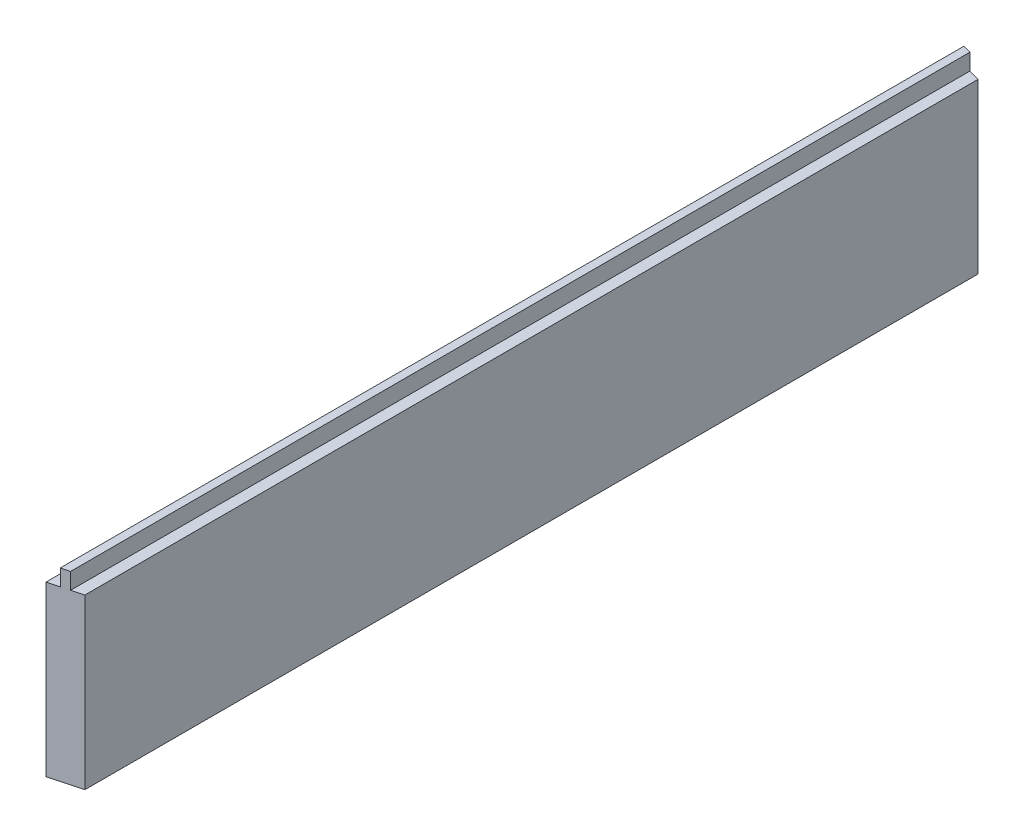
ISO-10303-21;
HEADER;
FILE_DESCRIPTION(('STEP AP214'),'2;1');
FILE_NAME('part.step','',(''),(''),'','','');
FILE_SCHEMA(('AUTOMOTIVE_DESIGN { 1 0 10303 214 1 1 1 1 }'));
ENDSEC;
DATA;
#1=APPLICATION_CONTEXT('core data for automotive mechanical design processes');
#2=APPLICATION_PROTOCOL_DEFINITION('international standard','automotive_design',2000,#1);
#3=PRODUCT_CONTEXT('',#1,'mechanical');
#4=PRODUCT('Part','Part','',(#3));
#5=PRODUCT_RELATED_PRODUCT_CATEGORY('part','',(#4));
#6=PRODUCT_DEFINITION_FORMATION('','',#4);
#7=PRODUCT_DEFINITION_CONTEXT('part definition',#1,'design');
#8=PRODUCT_DEFINITION('design','',#6,#7);
#9=PRODUCT_DEFINITION_SHAPE('','',#8);
#10=(LENGTH_UNIT() NAMED_UNIT(*) SI_UNIT(.MILLI.,.METRE.));
#11=(NAMED_UNIT(*) PLANE_ANGLE_UNIT() SI_UNIT($,.RADIAN.));
#12=(NAMED_UNIT(*) SI_UNIT($,.STERADIAN.) SOLID_ANGLE_UNIT());
#13=UNCERTAINTY_MEASURE_WITH_UNIT(LENGTH_MEASURE(1.E-05),#10,'distance_accuracy_value','');
#14=(GEOMETRIC_REPRESENTATION_CONTEXT(3) GLOBAL_UNCERTAINTY_ASSIGNED_CONTEXT((#13)) GLOBAL_UNIT_ASSIGNED_CONTEXT((#10,
#11,#12)) REPRESENTATION_CONTEXT('',''));
#15=CARTESIAN_POINT('',(0.,0.,0.));
#16=DIRECTION('',(0.,0.,1.));
#17=DIRECTION('',(1.,0.,0.));
#18=AXIS2_PLACEMENT_3D('',#15,#16,#17);
#19=CARTESIAN_POINT('',(0.,41.2499999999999,445.));
#20=DIRECTION('',(0.,-1.,0.));
#21=DIRECTION('',(1.,0.,0.));
#22=AXIS2_PLACEMENT_3D('',#19,#20,#21);
#23=PLANE('',#22);
#24=DIRECTION('',(0.965925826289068,0.,0.258819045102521));
#25=VECTOR('',#24,1.);
#26=CARTESIAN_POINT('',(110.747595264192,41.2499999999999,31.6843476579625));
#27=LINE('',#26,#25);
#28=CARTESIAN_POINT('',(2.,41.2499999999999,2.54551732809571));
#29=VERTEX_POINT('',#28);
#30=CARTESIAN_POINT('',(7.49999999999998,41.2499999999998,4.01923788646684));
#31=VERTEX_POINT('',#30);
#32=EDGE_CURVE('E102',#29,#31,#27,.T.);
#33=ORIENTED_EDGE('',*,*,#32,.F.);
#34=DIRECTION('',(0.,0.,-1.));
#35=VECTOR('',#34,1.);
#36=CARTESIAN_POINT('',(2.,41.2499999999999,445.));
#37=LINE('',#36,#35);
#38=CARTESIAN_POINT('',(2.,41.2499999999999,442.454482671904));
#39=VERTEX_POINT('',#38);
#40=EDGE_CURVE('E11',#39,#29,#37,.T.);
#41=ORIENTED_EDGE('',*,*,#40,.F.);
#42=DIRECTION('',(0.965925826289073,0.,-0.258819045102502));
#43=VECTOR('',#42,1.);
#44=CARTESIAN_POINT('',(-0.502404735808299,41.2499999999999,443.125));
#45=LINE('',#44,#43);
#46=CARTESIAN_POINT('',(7.49999999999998,41.2499999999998,440.980762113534));
#47=VERTEX_POINT('',#46);
#48=EDGE_CURVE('E166',#39,#47,#45,.T.);
#49=ORIENTED_EDGE('',*,*,#48,.T.);
#50=DIRECTION('',(0.,0.,-1.));
#51=VECTOR('',#50,1.);
#52=CARTESIAN_POINT('',(7.49999999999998,41.2499999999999,445.));
#53=LINE('',#52,#51);
#54=EDGE_CURVE('E121',#47,#31,#53,.T.);
#55=ORIENTED_EDGE('',*,*,#54,.T.);
#56=EDGE_LOOP('',(#33,#41,#49,#55));
#57=FACE_BOUND('',#56,.T.);
#58=ADVANCED_FACE('F36',(#57),#23,.F.);
#59=CARTESIAN_POINT('',(2.,0.,445.));
#60=DIRECTION('',(1.,0.,0.));
#61=DIRECTION('',(0.,1.,0.));
#62=AXIS2_PLACEMENT_3D('',#59,#60,#61);
#63=PLANE('',#62);
#64=ORIENTED_EDGE('',*,*,#40,.T.);
#65=DIRECTION('',(0.,1.,0.));
#66=VECTOR('',#65,1.);
#67=CARTESIAN_POINT('',(2.,0.,2.54551732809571));
#68=LINE('',#67,#66);
#69=CARTESIAN_POINT('',(1.99999999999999,49.2499999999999,2.54551732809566));
#70=VERTEX_POINT('',#69);
#71=EDGE_CURVE('E149',#29,#70,#68,.T.);
#72=ORIENTED_EDGE('',*,*,#71,.T.);
#73=DIRECTION('',(0.,0.,-1.));
#74=VECTOR('',#73,1.);
#75=CARTESIAN_POINT('',(2.,49.2499999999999,445.));
#76=LINE('',#75,#74);
#77=CARTESIAN_POINT('',(1.99999999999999,49.2499999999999,442.454482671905));
#78=VERTEX_POINT('',#77);
#79=EDGE_CURVE('E45',#78,#70,#76,.T.);
#80=ORIENTED_EDGE('',*,*,#79,.F.);
#81=DIRECTION('',(0.,1.,0.));
#82=VECTOR('',#81,1.);
#83=CARTESIAN_POINT('',(2.,0.,442.454482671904));
#84=LINE('',#83,#82);
#85=EDGE_CURVE('E147',#39,#78,#84,.T.);
#86=ORIENTED_EDGE('',*,*,#85,.F.);
#87=EDGE_LOOP('',(#64,#72,#80,#86));
#88=FACE_BOUND('',#87,.T.);
#89=ADVANCED_FACE('F38',(#88),#63,.T.);
#90=CARTESIAN_POINT('',(0.,49.2499999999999,445.));
#91=DIRECTION('',(0.,1.,0.));
#92=DIRECTION('',(0.,0.,1.));
#93=AXIS2_PLACEMENT_3D('',#90,#91,#92);
#94=PLANE('',#93);
#95=ORIENTED_EDGE('',*,*,#79,.T.);
#96=DIRECTION('',(-0.965925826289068,0.,-0.258819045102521));
#97=VECTOR('',#96,1.);
#98=CARTESIAN_POINT('',(7.49999999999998,49.2499999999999,4.01923788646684));
#99=LINE('',#98,#97);
#100=CARTESIAN_POINT('',(-2.,49.2499999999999,1.47372055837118));
#101=VERTEX_POINT('',#100);
#102=EDGE_CURVE('E116',#70,#101,#99,.T.);
#103=ORIENTED_EDGE('',*,*,#102,.T.);
#104=DIRECTION('',(0.,0.,-1.));
#105=VECTOR('',#104,1.);
#106=CARTESIAN_POINT('',(-2.,49.2499999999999,445.));
#107=LINE('',#106,#105);
#108=CARTESIAN_POINT('',(-2.,49.2499999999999,443.526279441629));
#109=VERTEX_POINT('',#108);
#110=EDGE_CURVE('E134',#109,#101,#107,.T.);
#111=ORIENTED_EDGE('',*,*,#110,.F.);
#112=DIRECTION('',(-0.965925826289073,0.,0.258819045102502));
#113=VECTOR('',#112,1.);
#114=CARTESIAN_POINT('',(7.49999999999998,49.2499999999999,440.980762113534));
#115=LINE('',#114,#113);
#116=EDGE_CURVE('E143',#78,#109,#115,.T.);
#117=ORIENTED_EDGE('',*,*,#116,.F.);
#118=EDGE_LOOP('',(#95,#103,#111,#117));
#119=FACE_BOUND('',#118,.T.);
#120=ADVANCED_FACE('F141',(#119),#94,.T.);
#121=CARTESIAN_POINT('',(-2.,0.,445.));
#122=DIRECTION('',(1.,0.,0.));
#123=DIRECTION('',(0.,1.,0.));
#124=AXIS2_PLACEMENT_3D('',#121,#122,#123);
#125=PLANE('',#124);
#126=DIRECTION('',(0.,1.,0.));
#127=VECTOR('',#126,1.);
#128=CARTESIAN_POINT('',(-2.,0.,1.47372055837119));
#129=LINE('',#128,#127);
#130=CARTESIAN_POINT('',(-2.,41.2499999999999,1.47372055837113));
#131=VERTEX_POINT('',#130);
#132=EDGE_CURVE('E150',#131,#101,#129,.T.);
#133=ORIENTED_EDGE('',*,*,#132,.F.);
#134=DIRECTION('',(0.,0.,-1.));
#135=VECTOR('',#134,1.);
#136=CARTESIAN_POINT('',(-2.,41.2499999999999,445.));
#137=LINE('',#136,#135);
#138=CARTESIAN_POINT('',(-2.,41.2499999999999,443.526279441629));
#139=VERTEX_POINT('',#138);
#140=EDGE_CURVE('E131',#139,#131,#137,.T.);
#141=ORIENTED_EDGE('',*,*,#140,.F.);
#142=DIRECTION('',(0.,1.,0.));
#143=VECTOR('',#142,1.);
#144=CARTESIAN_POINT('',(-2.,0.,443.526279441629));
#145=LINE('',#144,#143);
#146=EDGE_CURVE('E162',#139,#109,#145,.T.);
#147=ORIENTED_EDGE('',*,*,#146,.T.);
#148=ORIENTED_EDGE('',*,*,#110,.T.);
#149=EDGE_LOOP('',(#133,#141,#147,#148));
#150=FACE_BOUND('',#149,.T.);
#151=ADVANCED_FACE('F188',(#150),#125,.F.);
#152=DIRECTION('',(0.965925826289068,0.,0.258819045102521));
#153=VECTOR('',#152,1.);
#154=CARTESIAN_POINT('',(110.747595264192,41.2499999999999,31.6843476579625));
#155=LINE('',#154,#153);
#156=CARTESIAN_POINT('',(-7.49999999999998,41.2499999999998,0.));
#157=VERTEX_POINT('',#156);
#158=EDGE_CURVE('E153',#157,#131,#155,.T.);
#159=ORIENTED_EDGE('',*,*,#158,.F.);
#160=DIRECTION('',(0.,0.,-1.));
#161=VECTOR('',#160,1.);
#162=CARTESIAN_POINT('',(-7.49999999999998,41.2499999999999,445.));
#163=LINE('',#162,#161);
#164=CARTESIAN_POINT('',(-7.49999999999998,41.2499999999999,445.));
#165=VERTEX_POINT('',#164);
#166=EDGE_CURVE('E123',#165,#157,#163,.T.);
#167=ORIENTED_EDGE('',*,*,#166,.F.);
#168=DIRECTION('',(0.965925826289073,0.,-0.258819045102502));
#169=VECTOR('',#168,1.);
#170=CARTESIAN_POINT('',(-0.502404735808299,41.2499999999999,443.125));
#171=LINE('',#170,#169);
#172=EDGE_CURVE('E51',#165,#139,#171,.T.);
#173=ORIENTED_EDGE('',*,*,#172,.T.);
#174=ORIENTED_EDGE('',*,*,#140,.T.);
#175=EDGE_LOOP('',(#159,#167,#173,#174));
#176=FACE_BOUND('',#175,.T.);
#177=ADVANCED_FACE('F175',(#176),#23,.F.);
#178=CARTESIAN_POINT('',(0.,-41.2500000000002,445.));
#179=DIRECTION('',(0.,-1.,0.));
#180=DIRECTION('',(1.,0.,0.));
#181=AXIS2_PLACEMENT_3D('',#178,#179,#180);
#182=PLANE('',#181);
#183=DIRECTION('',(0.,0.,-1.));
#184=VECTOR('',#183,1.);
#185=CARTESIAN_POINT('',(-7.49999999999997,-41.2500000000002,445.));
#186=LINE('',#185,#184);
#187=CARTESIAN_POINT('',(-7.49999999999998,-41.2500000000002,445.));
#188=VERTEX_POINT('',#187);
#189=CARTESIAN_POINT('',(-7.49999999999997,-41.2500000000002,0.));
#190=VERTEX_POINT('',#189);
#191=EDGE_CURVE('E114',#188,#190,#186,.T.);
#192=ORIENTED_EDGE('',*,*,#191,.T.);
#193=DIRECTION('',(-0.965925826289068,0.,-0.258819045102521));
#194=VECTOR('',#193,1.);
#195=CARTESIAN_POINT('',(7.49999999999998,-41.2500000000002,4.01923788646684));
#196=LINE('',#195,#194);
#197=CARTESIAN_POINT('',(7.49999999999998,-41.2500000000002,4.01923788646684));
#198=VERTEX_POINT('',#197);
#199=EDGE_CURVE('E99',#198,#190,#196,.T.);
#200=ORIENTED_EDGE('',*,*,#199,.F.);
#201=DIRECTION('',(0.,0.,-1.));
#202=VECTOR('',#201,1.);
#203=CARTESIAN_POINT('',(7.50000000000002,-41.2500000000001,445.));
#204=LINE('',#203,#202);
#205=CARTESIAN_POINT('',(7.49999999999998,-41.2500000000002,440.980762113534));
#206=VERTEX_POINT('',#205);
#207=EDGE_CURVE('E112',#206,#198,#204,.T.);
#208=ORIENTED_EDGE('',*,*,#207,.F.);
#209=DIRECTION('',(-0.965925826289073,0.,0.258819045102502));
#210=VECTOR('',#209,1.);
#211=CARTESIAN_POINT('',(7.49999999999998,-41.2500000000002,440.980762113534));
#212=LINE('',#211,#210);
#213=EDGE_CURVE('E158',#206,#188,#212,.T.);
#214=ORIENTED_EDGE('',*,*,#213,.T.);
#215=EDGE_LOOP('',(#192,#200,#208,#214));
#216=FACE_BOUND('',#215,.T.);
#217=ADVANCED_FACE('F110',(#216),#182,.T.);
#218=CARTESIAN_POINT('',(7.5,0.,445.));
#219=DIRECTION('',(-1.,0.,0.));
#220=DIRECTION('',(0.,-1.,0.));
#221=AXIS2_PLACEMENT_3D('',#218,#219,#220);
#222=PLANE('',#221);
#223=DIRECTION('',(0.,1.,0.));
#224=VECTOR('',#223,1.);
#225=CARTESIAN_POINT('',(7.49999999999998,-41.2500000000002,4.01923788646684));
#226=LINE('',#225,#224);
#227=EDGE_CURVE('E96',#198,#31,#226,.T.);
#228=ORIENTED_EDGE('',*,*,#227,.T.);
#229=ORIENTED_EDGE('',*,*,#54,.F.);
#230=DIRECTION('',(0.,1.,0.));
#231=VECTOR('',#230,1.);
#232=CARTESIAN_POINT('',(7.49999999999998,-41.2500000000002,440.980762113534));
#233=LINE('',#232,#231);
#234=EDGE_CURVE('E120',#206,#47,#233,.T.);
#235=ORIENTED_EDGE('',*,*,#234,.F.);
#236=ORIENTED_EDGE('',*,*,#207,.T.);
#237=EDGE_LOOP('',(#228,#229,#235,#236));
#238=FACE_BOUND('',#237,.T.);
#239=ADVANCED_FACE('F119',(#238),#222,.F.);
#240=CARTESIAN_POINT('',(-7.49999999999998,0.,445.));
#241=DIRECTION('',(-1.,0.,0.));
#242=DIRECTION('',(0.,-1.,0.));
#243=AXIS2_PLACEMENT_3D('',#240,#241,#242);
#244=PLANE('',#243);
#245=DIRECTION('',(0.,1.,0.));
#246=VECTOR('',#245,1.);
#247=CARTESIAN_POINT('',(-7.49999999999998,0.,0.));
#248=LINE('',#247,#246);
#249=EDGE_CURVE('E169',#190,#157,#248,.T.);
#250=ORIENTED_EDGE('',*,*,#249,.F.);
#251=ORIENTED_EDGE('',*,*,#191,.F.);
#252=DIRECTION('',(0.,1.,0.));
#253=VECTOR('',#252,1.);
#254=CARTESIAN_POINT('',(-7.49999999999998,0.,445.));
#255=LINE('',#254,#253);
#256=EDGE_CURVE('E125',#188,#165,#255,.T.);
#257=ORIENTED_EDGE('',*,*,#256,.T.);
#258=ORIENTED_EDGE('',*,*,#166,.T.);
#259=EDGE_LOOP('',(#250,#251,#257,#258));
#260=FACE_BOUND('',#259,.T.);
#261=ADVANCED_FACE('F177',(#260),#244,.T.);
#262=CARTESIAN_POINT('',(7.49999999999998,-41.2500000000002,440.980762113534));
#263=DIRECTION('',(-0.258819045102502,0.,-0.965925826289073));
#264=DIRECTION('',(-0.965925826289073,0.,0.258819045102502));
#265=AXIS2_PLACEMENT_3D('',#262,#263,#264);
#266=PLANE('',#265);
#267=ORIENTED_EDGE('',*,*,#85,.T.);
#268=ORIENTED_EDGE('',*,*,#116,.T.);
#269=ORIENTED_EDGE('',*,*,#146,.F.);
#270=ORIENTED_EDGE('',*,*,#172,.F.);
#271=ORIENTED_EDGE('',*,*,#256,.F.);
#272=ORIENTED_EDGE('',*,*,#213,.F.);
#273=ORIENTED_EDGE('',*,*,#234,.T.);
#274=ORIENTED_EDGE('',*,*,#48,.F.);
#275=EDGE_LOOP('',(#267,#268,#269,#270,#271,#272,#273,#274));
#276=FACE_BOUND('',#275,.T.);
#277=ADVANCED_FACE('F178',(#276),#266,.F.);
#278=CARTESIAN_POINT('',(7.49999999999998,-41.2500000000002,4.01923788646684));
#279=DIRECTION('',(0.258819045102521,0.,-0.965925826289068));
#280=DIRECTION('',(-0.965925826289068,0.,-0.258819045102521));
#281=AXIS2_PLACEMENT_3D('',#278,#279,#280);
#282=PLANE('',#281);
#283=ORIENTED_EDGE('',*,*,#32,.T.);
#284=ORIENTED_EDGE('',*,*,#227,.F.);
#285=ORIENTED_EDGE('',*,*,#199,.T.);
#286=ORIENTED_EDGE('',*,*,#249,.T.);
#287=ORIENTED_EDGE('',*,*,#158,.T.);
#288=ORIENTED_EDGE('',*,*,#132,.T.);
#289=ORIENTED_EDGE('',*,*,#102,.F.);
#290=ORIENTED_EDGE('',*,*,#71,.F.);
#291=EDGE_LOOP('',(#283,#284,#285,#286,#287,#288,#289,#290));
#292=FACE_BOUND('',#291,.T.);
#293=ADVANCED_FACE('F98',(#292),#282,.T.);
#294=CLOSED_SHELL('',(#58,#89,#120,#151,#177,#217,#239,#261,#277,#293));
#295=MANIFOLD_SOLID_BREP('B2',#294);
#296=ADVANCED_BREP_SHAPE_REPRESENTATION('',(#18,#295),#14);
#297=SHAPE_DEFINITION_REPRESENTATION(#9,#296);
ENDSEC;
END-ISO-10303-21;
